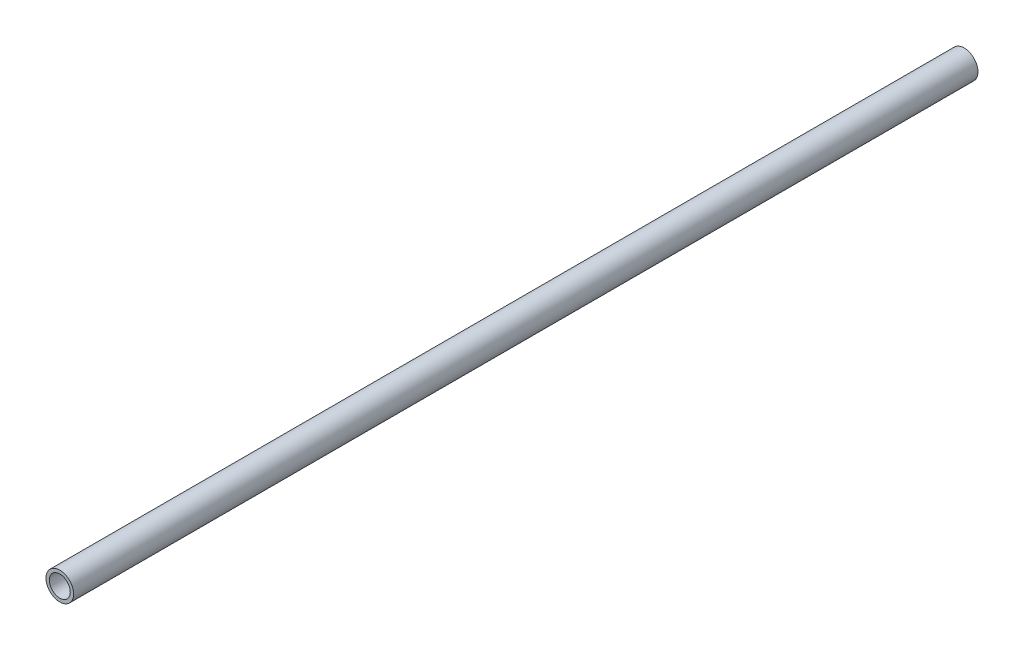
from build123d import *

# Parameters (mm, degrees)
ESQUISSE1_R      = 1.65
ESQUISSE1_R_2    = 1.25
EXTRUSION1_DEPTH = 108


with BuildPart() as part:
    # Esquisse1 → Extrusion1 (new body)
    with BuildSketch(Plane.XY):
        Circle(ESQUISSE1_R)
        Circle(ESQUISSE1_R_2, mode=Mode.SUBTRACT)
    extrude(amount=EXTRUSION1_DEPTH)


solid = part.part
